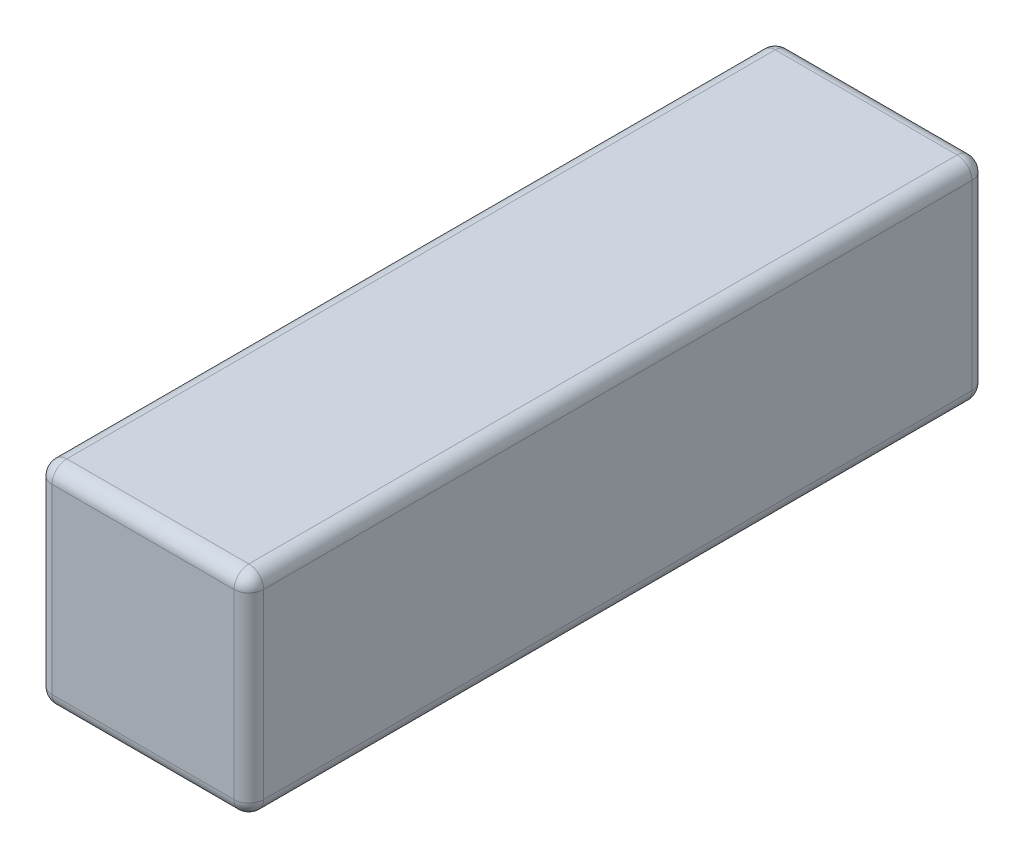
from build123d import *

# Parameters (mm, degrees)
EXTRUDE_1_DEPTH = 21.5
FILLET_1_R      = 3


with BuildPart() as part:
    # Sketch 1 → Extrude 1 (new, symmetric)
    with BuildSketch(Plane(origin=(0, 0, 0), x_dir=(1, 0, 0), z_dir=(0, 1, 0))):
        with BuildLine():
            Line((-18.5, -75), (18.5, -75))
            ThreePointArc((18.5, -75), (20.621320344, -74.121320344), (21.5, -72))
            Line((21.5, -72), (21.5, 72))
            ThreePointArc((21.5, 72), (20.621320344, 74.121320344), (18.5, 75))
            Line((18.5, 75), (-18.5, 75))
            ThreePointArc((-18.5, 75), (-20.621320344, 74.121320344), (-21.5, 72))
            Line((-21.5, 72), (-21.5, -72))
            ThreePointArc((-21.5, -72), (-20.621320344, -74.121320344), (-18.5, -75))
        make_face()
    extrude(amount=EXTRUDE_1_DEPTH, both=True)

    # Fillet 1
    fillet_1_edges = [part.edges().sort_by_distance(p)[0] for p in [
        (21.5, -21.5, 0),
        (20.621320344, -21.5, 74.121320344),
        (0, -21.5, 75),
        (-20.621320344, -21.5, 74.121320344),
        (20.621320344, 21.5, 74.121320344),
        (21.5, 21.5, 0),
        (20.621320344, 21.5, -74.121320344),
        (0, 21.5, -75),
        (-20.621320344, 21.5, -74.121320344),
        (-21.5, 21.5, 0),
        (-20.621320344, 21.5, 74.121320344),
        (-21.5, -21.5, 0),
        (0, 21.5, 75),
        (-20.621320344, -21.5, -74.121320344),
        (0, -21.5, -75),
        (20.621320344, -21.5, -74.121320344),
    ]]
    fillet(fillet_1_edges, radius=FILLET_1_R)


solid = part.part
